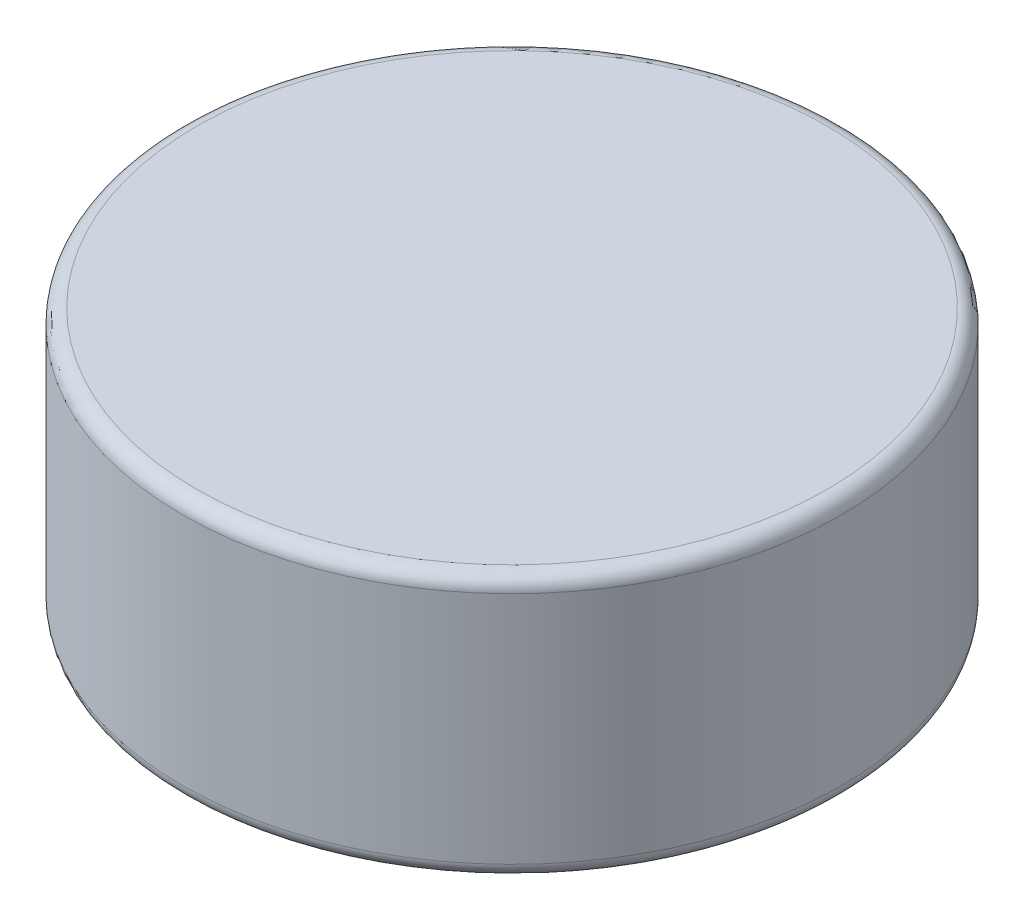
from build123d import *

# Parameters (mm, degrees)
SKETCH1_R           = 22.5
BOSS_EXTRUDE1_DEPTH = 18
FILLET1_R           = 1


with BuildPart() as part:
    # Sketch1 → Boss-Extrude1 (new body)
    with BuildSketch(Plane(origin=(0, 0, 0), x_dir=(1, 0, 0), z_dir=(0, 1, 0))):
        with Locations(Location((0, 0, 0), (0, 0, 270))):
            Circle(SKETCH1_R)
    extrude(amount=BOSS_EXTRUDE1_DEPTH)

    # Fillet1
    fillet1_edges = [part.edges().sort_by_distance(p)[0] for p in [
        (0, 0, -22.5),
        (0, 18, -22.5),
    ]]
    fillet(fillet1_edges, radius=FILLET1_R)


solid = part.part
